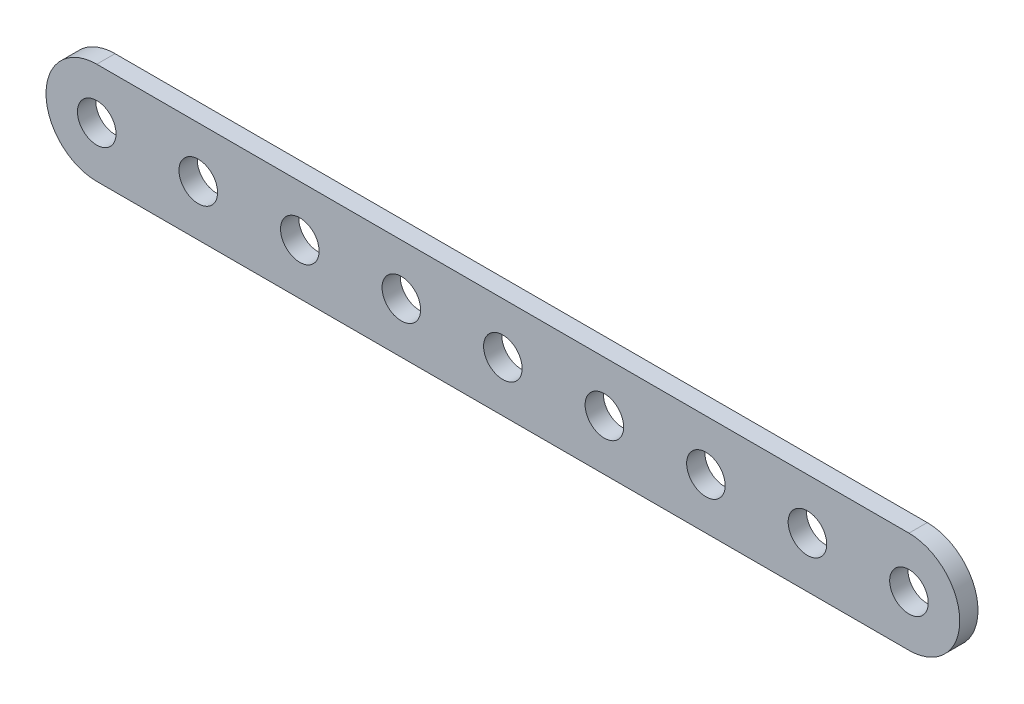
from build123d import *

# Parameters (mm, degrees)
BOSS_EXTRUDE1_DEPTH = 2.286
SKETCH2_R           = 2.413
CUT_EXTRUDE1_DEPTH  = 58.547118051
LPATTERN1_COUNT     = 9
LPATTERN1_PITCH     = 12.7


with BuildPart() as part:
    # Sketch1 → Boss-Extrude1 (new body)
    with BuildSketch(Plane.XY):
        with BuildLine():
            Line((-50.8, -6.35), (50.8, -6.35))
            ThreePointArc((50.8, -6.35), (57.15, 0), (50.8, 6.35))
            Line((50.8, 6.35), (-50.8, 6.35))
            ThreePointArc((-50.8, 6.35), (-57.15, 0), (-50.8, -6.35))
        make_face()
    extrude(amount=BOSS_EXTRUDE1_DEPTH)

    # Sketch2 → Cut-Extrude1 (cut, through all)
    with BuildSketch(Plane.XY.offset(2.286)):
        with Locations((-50.8, 0)):
            Circle(SKETCH2_R)
    cut_extrude1 = extrude(amount=-CUT_EXTRUDE1_DEPTH, mode=Mode.SUBTRACT)

    # LPattern1: Cut-Extrude1 ×9
    with Locations(*[(i * LPATTERN1_PITCH, 0, 0) for i in range(1, LPATTERN1_COUNT)]):
        add(cut_extrude1, mode=Mode.SUBTRACT)


solid = part.part
